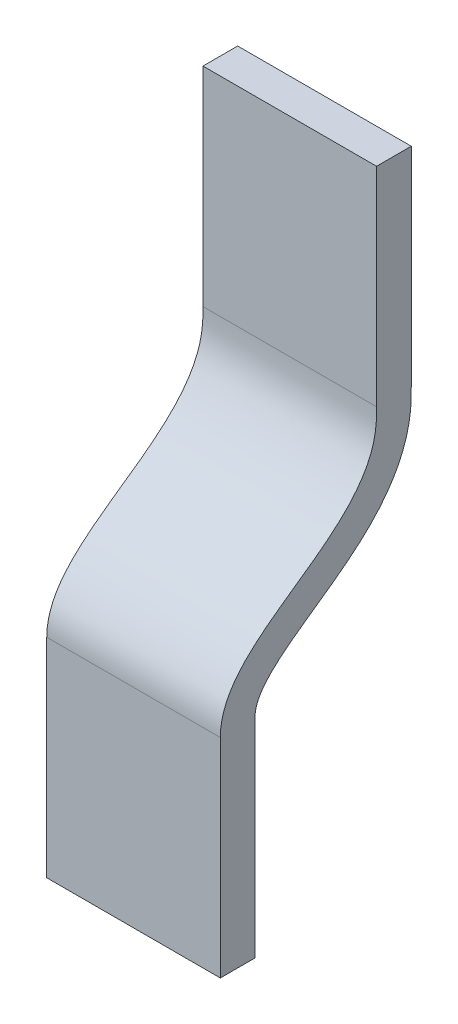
ISO-10303-21;
HEADER;
FILE_DESCRIPTION(('STEP AP214'),'2;1');
FILE_NAME('part.step','',(''),(''),'','','');
FILE_SCHEMA(('AUTOMOTIVE_DESIGN { 1 0 10303 214 1 1 1 1 }'));
ENDSEC;
DATA;
#1=APPLICATION_CONTEXT('core data for automotive mechanical design processes');
#2=APPLICATION_PROTOCOL_DEFINITION('international standard','automotive_design',2000,#1);
#3=PRODUCT_CONTEXT('',#1,'mechanical');
#4=PRODUCT('Part','Part','',(#3));
#5=PRODUCT_RELATED_PRODUCT_CATEGORY('part','',(#4));
#6=PRODUCT_DEFINITION_FORMATION('','',#4);
#7=PRODUCT_DEFINITION_CONTEXT('part definition',#1,'design');
#8=PRODUCT_DEFINITION('design','',#6,#7);
#9=PRODUCT_DEFINITION_SHAPE('','',#8);
#10=(LENGTH_UNIT() NAMED_UNIT(*) SI_UNIT(.MILLI.,.METRE.));
#11=(NAMED_UNIT(*) PLANE_ANGLE_UNIT() SI_UNIT($,.RADIAN.));
#12=(NAMED_UNIT(*) SI_UNIT($,.STERADIAN.) SOLID_ANGLE_UNIT());
#13=UNCERTAINTY_MEASURE_WITH_UNIT(LENGTH_MEASURE(1.E-05),#10,'distance_accuracy_value','');
#14=(GEOMETRIC_REPRESENTATION_CONTEXT(3) GLOBAL_UNCERTAINTY_ASSIGNED_CONTEXT((#13)) GLOBAL_UNIT_ASSIGNED_CONTEXT((#10,
#11,#12)) REPRESENTATION_CONTEXT('',''));
#15=CARTESIAN_POINT('',(0.,0.,0.));
#16=DIRECTION('',(0.,0.,1.));
#17=DIRECTION('',(1.,0.,0.));
#18=AXIS2_PLACEMENT_3D('',#15,#16,#17);
#19=CARTESIAN_POINT('',(50.,120.,-55.));
#20=DIRECTION('',(0.,0.,1.));
#21=DIRECTION('',(1.,0.,0.));
#22=AXIS2_PLACEMENT_3D('',#19,#20,#21);
#23=PLANE('',#22);
#24=DIRECTION('',(0.,1.,0.));
#25=VECTOR('',#24,1.);
#26=CARTESIAN_POINT('',(0.,120.,-55.));
#27=LINE('',#26,#25);
#28=CARTESIAN_POINT('',(0.,120.,-55.));
#29=VERTEX_POINT('',#28);
#30=CARTESIAN_POINT('',(0.,180.,-55.));
#31=VERTEX_POINT('',#30);
#32=EDGE_CURVE('E132',#29,#31,#27,.T.);
#33=ORIENTED_EDGE('',*,*,#32,.T.);
#34=DIRECTION('',(-1.,0.,0.));
#35=VECTOR('',#34,1.);
#36=CARTESIAN_POINT('',(50.,180.,-55.));
#37=LINE('',#36,#35);
#38=CARTESIAN_POINT('',(50.,180.,-55.));
#39=VERTEX_POINT('',#38);
#40=EDGE_CURVE('E12',#39,#31,#37,.T.);
#41=ORIENTED_EDGE('',*,*,#40,.F.);
#42=DIRECTION('',(0.,1.,0.));
#43=VECTOR('',#42,1.);
#44=CARTESIAN_POINT('',(50.,120.,-55.));
#45=LINE('',#44,#43);
#46=CARTESIAN_POINT('',(50.,120.,-55.));
#47=VERTEX_POINT('',#46);
#48=EDGE_CURVE('E87',#47,#39,#45,.T.);
#49=ORIENTED_EDGE('',*,*,#48,.F.);
#50=DIRECTION('',(-1.,0.,0.));
#51=VECTOR('',#50,1.);
#52=CARTESIAN_POINT('',(50.,120.,-55.));
#53=LINE('',#52,#51);
#54=EDGE_CURVE('E131',#47,#29,#53,.T.);
#55=ORIENTED_EDGE('',*,*,#54,.T.);
#56=EDGE_LOOP('',(#33,#41,#49,#55));
#57=FACE_BOUND('',#56,.T.);
#58=ADVANCED_FACE('F32',(#57),#23,.F.);
#59=CARTESIAN_POINT('',(50.,180.,-45.));
#60=DIRECTION('',(0.,1.,0.));
#61=DIRECTION('',(0.,0.,1.));
#62=AXIS2_PLACEMENT_3D('',#59,#60,#61);
#63=PLANE('',#62);
#64=DIRECTION('',(0.,0.,-1.));
#65=VECTOR('',#64,1.);
#66=CARTESIAN_POINT('',(0.,180.,-45.));
#67=LINE('',#66,#65);
#68=CARTESIAN_POINT('',(0.,180.,-45.));
#69=VERTEX_POINT('',#68);
#70=EDGE_CURVE('E199',#69,#31,#67,.T.);
#71=ORIENTED_EDGE('',*,*,#70,.F.);
#72=DIRECTION('',(-1.,0.,0.));
#73=VECTOR('',#72,1.);
#74=CARTESIAN_POINT('',(50.,180.,-45.));
#75=LINE('',#74,#73);
#76=CARTESIAN_POINT('',(50.,180.,-45.));
#77=VERTEX_POINT('',#76);
#78=EDGE_CURVE('E40',#77,#69,#75,.T.);
#79=ORIENTED_EDGE('',*,*,#78,.F.);
#80=DIRECTION('',(0.,0.,-1.));
#81=VECTOR('',#80,1.);
#82=CARTESIAN_POINT('',(50.,180.,-45.));
#83=LINE('',#82,#81);
#84=EDGE_CURVE('E172',#77,#39,#83,.T.);
#85=ORIENTED_EDGE('',*,*,#84,.T.);
#86=ORIENTED_EDGE('',*,*,#40,.T.);
#87=EDGE_LOOP('',(#71,#79,#85,#86));
#88=FACE_BOUND('',#87,.T.);
#89=ADVANCED_FACE('F200',(#88),#63,.T.);
#90=CARTESIAN_POINT('',(50.,120.,-45.));
#91=DIRECTION('',(0.,0.,1.));
#92=DIRECTION('',(1.,0.,0.));
#93=AXIS2_PLACEMENT_3D('',#90,#91,#92);
#94=PLANE('',#93);
#95=DIRECTION('',(0.,1.,0.));
#96=VECTOR('',#95,1.);
#97=CARTESIAN_POINT('',(0.,120.,-45.));
#98=LINE('',#97,#96);
#99=CARTESIAN_POINT('',(0.,120.,-45.));
#100=VERTEX_POINT('',#99);
#101=EDGE_CURVE('E194',#100,#69,#98,.T.);
#102=ORIENTED_EDGE('',*,*,#101,.F.);
#103=DIRECTION('',(-1.,0.,0.));
#104=VECTOR('',#103,1.);
#105=CARTESIAN_POINT('',(50.,120.,-45.));
#106=LINE('',#105,#104);
#107=CARTESIAN_POINT('',(50.,120.,-45.));
#108=VERTEX_POINT('',#107);
#109=EDGE_CURVE('E189',#108,#100,#106,.T.);
#110=ORIENTED_EDGE('',*,*,#109,.F.);
#111=DIRECTION('',(0.,1.,0.));
#112=VECTOR('',#111,1.);
#113=CARTESIAN_POINT('',(50.,120.,-45.));
#114=LINE('',#113,#112);
#115=EDGE_CURVE('E166',#108,#77,#114,.T.);
#116=ORIENTED_EDGE('',*,*,#115,.T.);
#117=ORIENTED_EDGE('',*,*,#78,.T.);
#118=EDGE_LOOP('',(#102,#110,#116,#117));
#119=FACE_BOUND('',#118,.T.);
#120=ADVANCED_FACE('F156',(#119),#94,.T.);
#121=CARTESIAN_POINT('',(50.,60.,0.));
#122=CARTESIAN_POINT('',(50.,83.7500008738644,0.));
#123=CARTESIAN_POINT('',(50.,90.0703958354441,-45.));
#124=CARTESIAN_POINT('',(50.,118.574780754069,-45.));
#125=CARTESIAN_POINT('',(50.,120.,-45.));
#126=B_SPLINE_CURVE_WITH_KNOTS('',3,(#121,#122,#123,#124,#125),.UNSPECIFIED.,.F.,.F.,(4,1,4),
(0.,0.95,1.),.UNSPECIFIED.);
#127=DIRECTION('',(-1.,0.,0.));
#128=VECTOR('',#127,1.);
#129=SURFACE_OF_LINEAR_EXTRUSION('',#126,#128);
#130=CARTESIAN_POINT('',(0.,60.,0.));
#131=CARTESIAN_POINT('',(0.,83.7500008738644,0.));
#132=CARTESIAN_POINT('',(0.,90.0703958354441,-45.));
#133=CARTESIAN_POINT('',(0.,118.574780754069,-45.));
#134=CARTESIAN_POINT('',(0.,120.,-45.));
#135=B_SPLINE_CURVE_WITH_KNOTS('',3,(#130,#131,#132,#133,#134),.UNSPECIFIED.,.F.,.F.,(4,1,4),
(0.,0.95,1.),.UNSPECIFIED.);
#136=CARTESIAN_POINT('',(0.,60.,0.));
#137=VERTEX_POINT('',#136);
#138=EDGE_CURVE('E206',#137,#100,#135,.T.);
#139=ORIENTED_EDGE('',*,*,#138,.F.);
#140=DIRECTION('',(-1.,0.,0.));
#141=VECTOR('',#140,1.);
#142=CARTESIAN_POINT('',(50.,60.,0.));
#143=LINE('',#142,#141);
#144=CARTESIAN_POINT('',(50.,60.,0.));
#145=VERTEX_POINT('',#144);
#146=EDGE_CURVE('E187',#145,#137,#143,.T.);
#147=ORIENTED_EDGE('',*,*,#146,.F.);
#148=EDGE_CURVE('E123',#145,#108,#126,.T.);
#149=ORIENTED_EDGE('',*,*,#148,.T.);
#150=ORIENTED_EDGE('',*,*,#109,.T.);
#151=EDGE_LOOP('',(#139,#147,#149,#150));
#152=FACE_BOUND('',#151,.T.);
#153=ADVANCED_FACE('F151',(#152),#129,.T.);
#154=CARTESIAN_POINT('',(50.,0.,0.));
#155=DIRECTION('',(0.,0.,1.));
#156=DIRECTION('',(1.,0.,0.));
#157=AXIS2_PLACEMENT_3D('',#154,#155,#156);
#158=PLANE('',#157);
#159=DIRECTION('',(0.,1.,0.));
#160=VECTOR('',#159,1.);
#161=CARTESIAN_POINT('',(0.,0.,0.));
#162=LINE('',#161,#160);
#163=CARTESIAN_POINT('',(0.,0.,0.));
#164=VERTEX_POINT('',#163);
#165=EDGE_CURVE('E208',#164,#137,#162,.T.);
#166=ORIENTED_EDGE('',*,*,#165,.F.);
#167=DIRECTION('',(-1.,0.,0.));
#168=VECTOR('',#167,1.);
#169=CARTESIAN_POINT('',(50.,0.,0.));
#170=LINE('',#169,#168);
#171=CARTESIAN_POINT('',(50.,0.,0.));
#172=VERTEX_POINT('',#171);
#173=EDGE_CURVE('E111',#172,#164,#170,.T.);
#174=ORIENTED_EDGE('',*,*,#173,.F.);
#175=DIRECTION('',(0.,1.,0.));
#176=VECTOR('',#175,1.);
#177=CARTESIAN_POINT('',(50.,0.,0.));
#178=LINE('',#177,#176);
#179=EDGE_CURVE('E121',#172,#145,#178,.T.);
#180=ORIENTED_EDGE('',*,*,#179,.T.);
#181=ORIENTED_EDGE('',*,*,#146,.T.);
#182=EDGE_LOOP('',(#166,#174,#180,#181));
#183=FACE_BOUND('',#182,.T.);
#184=ADVANCED_FACE('F148',(#183),#158,.T.);
#185=CARTESIAN_POINT('',(50.,0.,-10.));
#186=DIRECTION('',(0.,-1.,0.));
#187=DIRECTION('',(0.,0.,-1.));
#188=AXIS2_PLACEMENT_3D('',#185,#186,#187);
#189=PLANE('',#188);
#190=DIRECTION('',(0.,0.,1.));
#191=VECTOR('',#190,1.);
#192=CARTESIAN_POINT('',(0.,0.,-10.));
#193=LINE('',#192,#191);
#194=CARTESIAN_POINT('',(0.,0.,-10.));
#195=VERTEX_POINT('',#194);
#196=EDGE_CURVE('E110',#195,#164,#193,.T.);
#197=ORIENTED_EDGE('',*,*,#196,.F.);
#198=DIRECTION('',(-1.,0.,0.));
#199=VECTOR('',#198,1.);
#200=CARTESIAN_POINT('',(50.,0.,-10.));
#201=LINE('',#200,#199);
#202=CARTESIAN_POINT('',(50.,0.,-10.));
#203=VERTEX_POINT('',#202);
#204=EDGE_CURVE('E104',#203,#195,#201,.T.);
#205=ORIENTED_EDGE('',*,*,#204,.F.);
#206=DIRECTION('',(0.,0.,1.));
#207=VECTOR('',#206,1.);
#208=CARTESIAN_POINT('',(50.,0.,-10.));
#209=LINE('',#208,#207);
#210=EDGE_CURVE('E108',#203,#172,#209,.T.);
#211=ORIENTED_EDGE('',*,*,#210,.T.);
#212=ORIENTED_EDGE('',*,*,#173,.T.);
#213=EDGE_LOOP('',(#197,#205,#211,#212));
#214=FACE_BOUND('',#213,.T.);
#215=ADVANCED_FACE('F106',(#214),#189,.T.);
#216=CARTESIAN_POINT('',(50.,0.,-10.));
#217=DIRECTION('',(0.,0.,1.));
#218=DIRECTION('',(1.,0.,0.));
#219=AXIS2_PLACEMENT_3D('',#216,#217,#218);
#220=PLANE('',#219);
#221=DIRECTION('',(0.,1.,0.));
#222=VECTOR('',#221,1.);
#223=CARTESIAN_POINT('',(0.,0.,-10.));
#224=LINE('',#223,#222);
#225=CARTESIAN_POINT('',(0.,60.,-10.));
#226=VERTEX_POINT('',#225);
#227=EDGE_CURVE('E75',#195,#226,#224,.T.);
#228=ORIENTED_EDGE('',*,*,#227,.T.);
#229=DIRECTION('',(-1.,0.,0.));
#230=VECTOR('',#229,1.);
#231=CARTESIAN_POINT('',(50.,60.,-10.));
#232=LINE('',#231,#230);
#233=CARTESIAN_POINT('',(50.,60.,-10.));
#234=VERTEX_POINT('',#233);
#235=EDGE_CURVE('E112',#234,#226,#232,.T.);
#236=ORIENTED_EDGE('',*,*,#235,.F.);
#237=DIRECTION('',(0.,1.,0.));
#238=VECTOR('',#237,1.);
#239=CARTESIAN_POINT('',(50.,0.,-10.));
#240=LINE('',#239,#238);
#241=EDGE_CURVE('E114',#203,#234,#240,.T.);
#242=ORIENTED_EDGE('',*,*,#241,.F.);
#243=ORIENTED_EDGE('',*,*,#204,.T.);
#244=EDGE_LOOP('',(#228,#236,#242,#243));
#245=FACE_BOUND('',#244,.T.);
#246=ADVANCED_FACE('F115',(#245),#220,.F.);
#247=CARTESIAN_POINT('',(50.,60.,-10.));
#248=CARTESIAN_POINT('',(50.,60.7730264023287,-10.));
#249=CARTESIAN_POINT('',(50.,61.4420670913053,-10.0864803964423));
#250=CARTESIAN_POINT('',(50.,62.7535090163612,-10.4064131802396));
#251=CARTESIAN_POINT('',(50.,63.3994196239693,-10.6429424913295));
#252=CARTESIAN_POINT('',(50.,64.7787550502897,-11.3284000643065));
#253=CARTESIAN_POINT('',(50.,65.5105789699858,-11.7800759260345));
#254=CARTESIAN_POINT('',(50.,67.0669980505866,-12.9444365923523));
#255=CARTESIAN_POINT('',(50.,67.8895020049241,-13.6569165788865));
#256=CARTESIAN_POINT('',(50.,69.5970514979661,-15.3345140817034));
#257=CARTESIAN_POINT('',(50.,70.4814134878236,-16.2987832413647));
#258=CARTESIAN_POINT('',(50.,72.2918436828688,-18.4388628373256));
#259=CARTESIAN_POINT('',(50.,73.2179021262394,-19.6141814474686));
#260=CARTESIAN_POINT('',(50.,75.1076228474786,-22.1250246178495));
#261=CARTESIAN_POINT('',(50.,76.0713935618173,-23.4603606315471));
#262=CARTESIAN_POINT('',(50.,78.0459938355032,-26.2394046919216));
#263=CARTESIAN_POINT('',(50.,79.0568870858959,-27.6830716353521));
#264=CARTESIAN_POINT('',(50.,81.1457239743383,-30.6293624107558));
#265=CARTESIAN_POINT('',(50.,82.2236671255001,-32.1320292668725));
#266=CARTESIAN_POINT('',(50.,84.4761629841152,-35.1491327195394));
#267=CARTESIAN_POINT('',(50.,85.6506815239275,-36.6637141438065));
#268=CARTESIAN_POINT('',(50.,88.1361431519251,-39.6570039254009));
#269=CARTESIAN_POINT('',(50.,89.4471278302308,-41.1360292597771));
#270=CARTESIAN_POINT('',(50.,92.2560435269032,-44.0034738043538));
#271=CARTESIAN_POINT('',(50.,93.7543772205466,-45.3923881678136));
#272=CARTESIAN_POINT('',(50.,96.9938865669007,-48.0053901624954));
#273=CARTESIAN_POINT('',(50.,98.7361797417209,-49.2296951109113));
#274=CARTESIAN_POINT('',(50.,102.50312828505,-51.4064999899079));
#275=CARTESIAN_POINT('',(50.,104.528975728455,-52.3578294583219));
#276=CARTESIAN_POINT('',(50.,108.847000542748,-53.8589633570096));
#277=CARTESIAN_POINT('',(50.,111.138151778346,-54.4066189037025));
#278=CARTESIAN_POINT('',(50.,113.81889910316,-54.7420991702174));
#279=CARTESIAN_POINT('',(50.,114.1181721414,-54.775520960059));
#280=CARTESIAN_POINT('',(50.,114.719361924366,-54.8345546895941));
#281=CARTESIAN_POINT('',(50.,115.02370012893,-54.8602617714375));
#282=CARTESIAN_POINT('',(50.,115.914940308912,-54.9242826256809));
#283=CARTESIAN_POINT('',(50.,116.483874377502,-54.9505900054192));
#284=CARTESIAN_POINT('',(50.,118.11717316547,-55.0017285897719));
#285=CARTESIAN_POINT('',(50.,119.109237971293,-55.));
#286=CARTESIAN_POINT('',(50.,120.,-55.));
#287=B_SPLINE_CURVE_WITH_KNOTS('',3,(#247,#248,#249,#250,#251,#252,#253,#254,#255,#256,#257,
#258,#259,#260,#261,#262,#263,#264,#265,#266,#267,#268,#269,#270,#271,#272,#273,#274,#275,#276,
#277,#278,#279,#280,#281,#282,#283,#284,#285,#286),.UNSPECIFIED.,.F.,.F.,(4,2,2,2,2,2,2,2,2,2,2,
2,2,2,2,2,2,2,2,4),(0.,0.0624999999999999,0.125,0.1875,0.25,0.3125,0.375,0.437499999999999,
0.499999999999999,0.562499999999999,0.624999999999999,0.687499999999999,0.749999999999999,
0.812499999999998,0.874999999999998,0.937499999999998,0.945312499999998,0.953124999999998,
0.968749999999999,1.),.UNSPECIFIED.);
#288=DIRECTION('',(-1.,0.,0.));
#289=VECTOR('',#288,1.);
#290=SURFACE_OF_LINEAR_EXTRUSION('',#287,#289);
#291=CARTESIAN_POINT('',(0.,60.,-10.));
#292=CARTESIAN_POINT('',(0.,60.7730264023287,-10.));
#293=CARTESIAN_POINT('',(0.,61.4420670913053,-10.0864803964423));
#294=CARTESIAN_POINT('',(0.,62.7535090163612,-10.4064131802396));
#295=CARTESIAN_POINT('',(0.,63.3994196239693,-10.6429424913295));
#296=CARTESIAN_POINT('',(0.,64.7787550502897,-11.3284000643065));
#297=CARTESIAN_POINT('',(0.,65.5105789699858,-11.7800759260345));
#298=CARTESIAN_POINT('',(0.,67.0669980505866,-12.9444365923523));
#299=CARTESIAN_POINT('',(0.,67.8895020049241,-13.6569165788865));
#300=CARTESIAN_POINT('',(0.,69.5970514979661,-15.3345140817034));
#301=CARTESIAN_POINT('',(0.,70.4814134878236,-16.2987832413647));
#302=CARTESIAN_POINT('',(0.,72.2918436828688,-18.4388628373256));
#303=CARTESIAN_POINT('',(0.,73.2179021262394,-19.6141814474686));
#304=CARTESIAN_POINT('',(0.,75.1076228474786,-22.1250246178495));
#305=CARTESIAN_POINT('',(0.,76.0713935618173,-23.4603606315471));
#306=CARTESIAN_POINT('',(0.,78.0459938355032,-26.2394046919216));
#307=CARTESIAN_POINT('',(0.,79.0568870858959,-27.6830716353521));
#308=CARTESIAN_POINT('',(0.,81.1457239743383,-30.6293624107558));
#309=CARTESIAN_POINT('',(0.,82.2236671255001,-32.1320292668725));
#310=CARTESIAN_POINT('',(0.,84.4761629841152,-35.1491327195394));
#311=CARTESIAN_POINT('',(0.,85.6506815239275,-36.6637141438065));
#312=CARTESIAN_POINT('',(0.,88.1361431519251,-39.6570039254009));
#313=CARTESIAN_POINT('',(0.,89.4471278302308,-41.1360292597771));
#314=CARTESIAN_POINT('',(0.,92.2560435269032,-44.0034738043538));
#315=CARTESIAN_POINT('',(0.,93.7543772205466,-45.3923881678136));
#316=CARTESIAN_POINT('',(0.,96.9938865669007,-48.0053901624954));
#317=CARTESIAN_POINT('',(0.,98.7361797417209,-49.2296951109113));
#318=CARTESIAN_POINT('',(0.,102.50312828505,-51.4064999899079));
#319=CARTESIAN_POINT('',(0.,104.528975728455,-52.3578294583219));
#320=CARTESIAN_POINT('',(0.,108.847000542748,-53.8589633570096));
#321=CARTESIAN_POINT('',(0.,111.138151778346,-54.4066189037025));
#322=CARTESIAN_POINT('',(0.,113.81889910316,-54.7420991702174));
#323=CARTESIAN_POINT('',(0.,114.1181721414,-54.775520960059));
#324=CARTESIAN_POINT('',(0.,114.719361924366,-54.8345546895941));
#325=CARTESIAN_POINT('',(0.,115.02370012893,-54.8602617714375));
#326=CARTESIAN_POINT('',(0.,115.914940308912,-54.9242826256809));
#327=CARTESIAN_POINT('',(0.,116.483874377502,-54.9505900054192));
#328=CARTESIAN_POINT('',(0.,118.11717316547,-55.0017285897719));
#329=CARTESIAN_POINT('',(0.,119.109237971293,-55.));
#330=CARTESIAN_POINT('',(0.,120.,-55.));
#331=B_SPLINE_CURVE_WITH_KNOTS('',3,(#291,#292,#293,#294,#295,#296,#297,#298,#299,#300,#301,
#302,#303,#304,#305,#306,#307,#308,#309,#310,#311,#312,#313,#314,#315,#316,#317,#318,#319,#320,
#321,#322,#323,#324,#325,#326,#327,#328,#329,#330),.UNSPECIFIED.,.F.,.F.,(4,2,2,2,2,2,2,2,2,2,2,
2,2,2,2,2,2,2,2,4),(0.,0.0624999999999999,0.125,0.1875,0.25,0.3125,0.375,0.437499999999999,
0.499999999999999,0.562499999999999,0.624999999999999,0.687499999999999,0.749999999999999,
0.812499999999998,0.874999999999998,0.937499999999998,0.945312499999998,0.953124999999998,
0.968749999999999,1.),.UNSPECIFIED.);
#332=EDGE_CURVE('E81',#226,#29,#331,.T.);
#333=ORIENTED_EDGE('',*,*,#332,.T.);
#334=ORIENTED_EDGE('',*,*,#54,.F.);
#335=EDGE_CURVE('E48',#234,#47,#287,.T.);
#336=ORIENTED_EDGE('',*,*,#335,.F.);
#337=ORIENTED_EDGE('',*,*,#235,.T.);
#338=EDGE_LOOP('',(#333,#334,#336,#337));
#339=FACE_BOUND('',#338,.T.);
#340=ADVANCED_FACE('F138',(#339),#290,.F.);
#341=CARTESIAN_POINT('',(50.,88.2590931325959,-23.3725761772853));
#342=DIRECTION('',(1.,0.,0.));
#343=DIRECTION('',(0.,0.,-1.));
#344=AXIS2_PLACEMENT_3D('',#341,#342,#343);
#345=PLANE('',#344);
#346=ORIENTED_EDGE('',*,*,#48,.T.);
#347=ORIENTED_EDGE('',*,*,#84,.F.);
#348=ORIENTED_EDGE('',*,*,#115,.F.);
#349=ORIENTED_EDGE('',*,*,#148,.F.);
#350=ORIENTED_EDGE('',*,*,#179,.F.);
#351=ORIENTED_EDGE('',*,*,#210,.F.);
#352=ORIENTED_EDGE('',*,*,#241,.T.);
#353=ORIENTED_EDGE('',*,*,#335,.T.);
#354=EDGE_LOOP('',(#346,#347,#348,#349,#350,#351,#352,#353));
#355=FACE_BOUND('',#354,.T.);
#356=ADVANCED_FACE('F118',(#355),#345,.T.);
#357=CARTESIAN_POINT('',(0.,88.2590931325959,-23.3725761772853));
#358=DIRECTION('',(1.,0.,0.));
#359=DIRECTION('',(0.,0.,-1.));
#360=AXIS2_PLACEMENT_3D('',#357,#358,#359);
#361=PLANE('',#360);
#362=ORIENTED_EDGE('',*,*,#32,.F.);
#363=ORIENTED_EDGE('',*,*,#332,.F.);
#364=ORIENTED_EDGE('',*,*,#227,.F.);
#365=ORIENTED_EDGE('',*,*,#196,.T.);
#366=ORIENTED_EDGE('',*,*,#165,.T.);
#367=ORIENTED_EDGE('',*,*,#138,.T.);
#368=ORIENTED_EDGE('',*,*,#101,.T.);
#369=ORIENTED_EDGE('',*,*,#70,.T.);
#370=EDGE_LOOP('',(#362,#363,#364,#365,#366,#367,#368,#369));
#371=FACE_BOUND('',#370,.T.);
#372=ADVANCED_FACE('F142',(#371),#361,.F.);
#373=CLOSED_SHELL('',(#58,#89,#120,#153,#184,#215,#246,#340,#356,#372));
#374=MANIFOLD_SOLID_BREP('B2',#373);
#375=ADVANCED_BREP_SHAPE_REPRESENTATION('',(#18,#374),#14);
#376=SHAPE_DEFINITION_REPRESENTATION(#9,#375);
ENDSEC;
END-ISO-10303-21;
